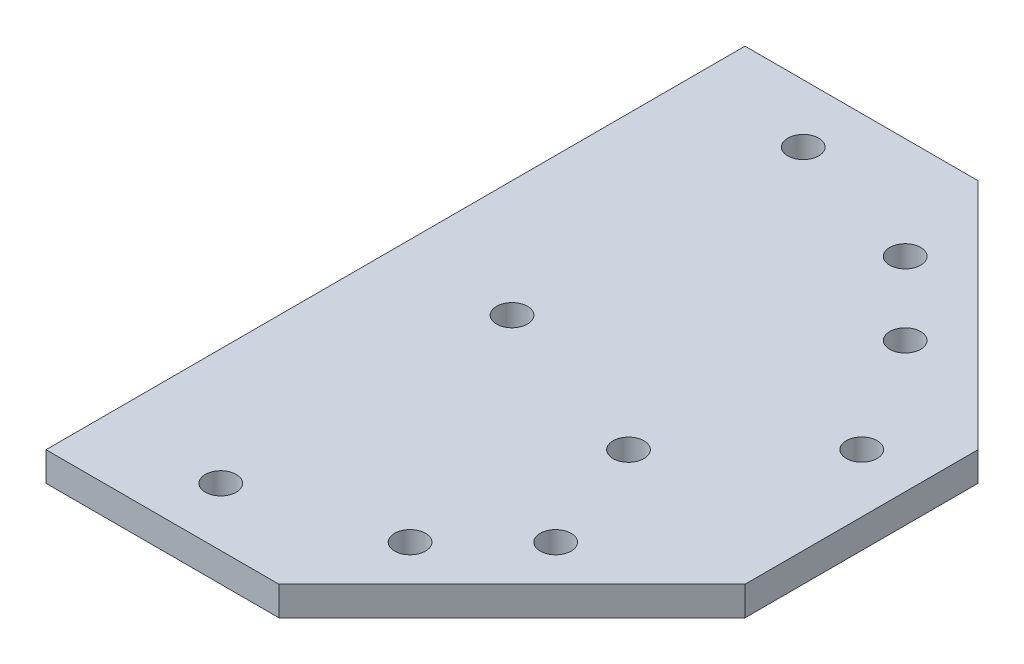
from build123d import *

# Parameters (mm, degrees)
SKETCH1_R      = 3.37312
EXTRUDE1_DEPTH = 6.35


with BuildPart() as part:
    # Sketch1 → Extrude1 (new body)
    with BuildSketch(Plane(origin=(0, 0, 0), x_dir=(1, 0, 0), z_dir=(0, 1, 0))):
        Polygon((101.6, 0), (50.8, -50.8), (0, -50.8), (0, 0), (0, 50.8), (0, 101.6), (50.8, 101.6), (101.6, 50.8), align=None)
        with Locations(Location((73.025, -12.7, 0), (0, 0, 270))):
            Circle(SKETCH1_R, mode=Mode.SUBTRACT)
        with Locations(Location((57.15, -28.575, 0), (0, 0, 270))):
            Circle(SKETCH1_R, mode=Mode.SUBTRACT)
        with Locations(Location((88.9, 38.153436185, 0), (0, 0, 270))):
            Circle(SKETCH1_R, mode=Mode.SUBTRACT)
        with Locations(Location((63.5, 12.7, 0), (0, 0, 270))):
            Circle(SKETCH1_R, mode=Mode.SUBTRACT)
        with Locations(Location((25.4, 88.9, 0), (0, 0, 270))):
            Circle(SKETCH1_R, mode=Mode.SUBTRACT)
        with Locations(Location((25.4, -38.1, 0), (0, 0, 90))):
            Circle(SKETCH1_R, mode=Mode.SUBTRACT)
        with Locations(Location((25.4, 25.4, 0), (0, 0, 270))):
            Circle(SKETCH1_R, mode=Mode.SUBTRACT)
        with Locations(Location((73.025, 63.5, 0), (0, 0, 90))):
            Circle(SKETCH1_R, mode=Mode.SUBTRACT)
        with Locations(Location((57.15, 79.375, 0), (0, 0, 90))):
            Circle(SKETCH1_R, mode=Mode.SUBTRACT)
    extrude(amount=EXTRUDE1_DEPTH)


solid = part.part
